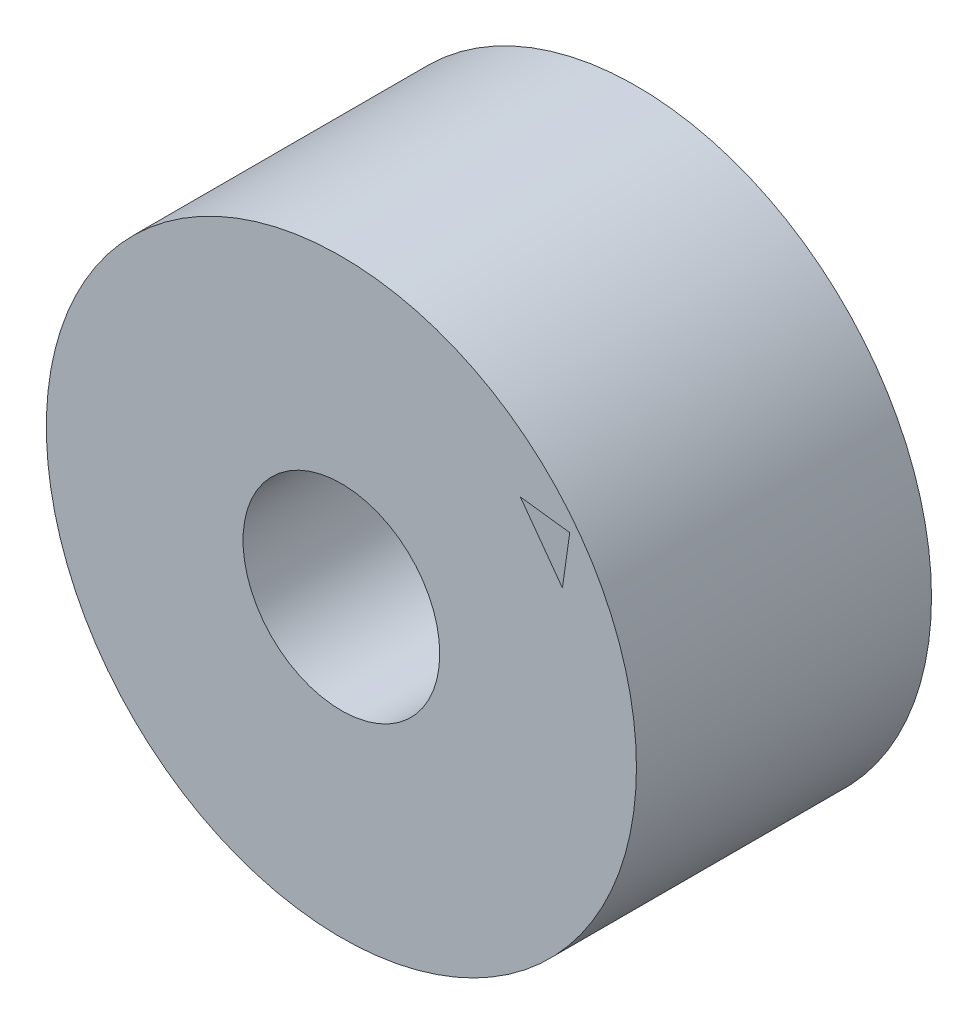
ISO-10303-21;
HEADER;
FILE_DESCRIPTION(('STEP AP214'),'2;1');
FILE_NAME('part.step','',(''),(''),'','','');
FILE_SCHEMA(('AUTOMOTIVE_DESIGN { 1 0 10303 214 1 1 1 1 }'));
ENDSEC;
DATA;
#1=APPLICATION_CONTEXT('core data for automotive mechanical design processes');
#2=APPLICATION_PROTOCOL_DEFINITION('international standard','automotive_design',2000,#1);
#3=PRODUCT_CONTEXT('',#1,'mechanical');
#4=PRODUCT('Part','Part','',(#3));
#5=PRODUCT_RELATED_PRODUCT_CATEGORY('part','',(#4));
#6=PRODUCT_DEFINITION_FORMATION('','',#4);
#7=PRODUCT_DEFINITION_CONTEXT('part definition',#1,'design');
#8=PRODUCT_DEFINITION('design','',#6,#7);
#9=PRODUCT_DEFINITION_SHAPE('','',#8);
#10=(LENGTH_UNIT() NAMED_UNIT(*) SI_UNIT(.MILLI.,.METRE.));
#11=(NAMED_UNIT(*) PLANE_ANGLE_UNIT() SI_UNIT($,.RADIAN.));
#12=(NAMED_UNIT(*) SI_UNIT($,.STERADIAN.) SOLID_ANGLE_UNIT());
#13=UNCERTAINTY_MEASURE_WITH_UNIT(LENGTH_MEASURE(1.E-05),#10,'distance_accuracy_value','');
#14=(GEOMETRIC_REPRESENTATION_CONTEXT(3) GLOBAL_UNCERTAINTY_ASSIGNED_CONTEXT((#13)) GLOBAL_UNIT_ASSIGNED_CONTEXT((#10,
#11,#12)) REPRESENTATION_CONTEXT('',''));
#15=CARTESIAN_POINT('',(0.,0.,0.));
#16=DIRECTION('',(0.,0.,1.));
#17=DIRECTION('',(1.,0.,0.));
#18=AXIS2_PLACEMENT_3D('',#15,#16,#17);
#19=CARTESIAN_POINT('',(0.,0.,15.));
#20=DIRECTION('',(0.,0.,-1.));
#21=DIRECTION('',(-1.,0.,0.));
#22=AXIS2_PLACEMENT_3D('',#19,#20,#21);
#23=CYLINDRICAL_SURFACE('',#22,5.);
#24=CARTESIAN_POINT('',(0.,0.,15.));
#25=DIRECTION('',(0.,0.,-1.));
#26=DIRECTION('',(1.,0.,0.));
#27=AXIS2_PLACEMENT_3D('',#24,#25,#26);
#28=CIRCLE('',#27,5.);
#29=CARTESIAN_POINT('',(4.99999999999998,0.,15.));
#30=VERTEX_POINT('',#29);
#31=EDGE_CURVE('E11',#30,#30,#28,.T.);
#32=ORIENTED_EDGE('',*,*,#31,.F.);
#33=EDGE_LOOP('',(#32));
#34=FACE_BOUND('',#33,.T.);
#35=CARTESIAN_POINT('',(0.,0.,0.));
#36=DIRECTION('',(0.,0.,-1.));
#37=DIRECTION('',(1.,0.,0.));
#38=AXIS2_PLACEMENT_3D('',#35,#36,#37);
#39=CIRCLE('',#38,5.);
#40=CARTESIAN_POINT('',(5.,0.,0.));
#41=VERTEX_POINT('',#40);
#42=EDGE_CURVE('E113',#41,#41,#39,.T.);
#43=ORIENTED_EDGE('',*,*,#42,.T.);
#44=EDGE_LOOP('',(#43));
#45=FACE_BOUND('',#44,.T.);
#46=ADVANCED_FACE('F46',(#34,#45),#23,.F.);
#47=CARTESIAN_POINT('',(0.,0.,15.));
#48=DIRECTION('',(0.,0.,-1.));
#49=DIRECTION('',(-1.,0.,0.));
#50=AXIS2_PLACEMENT_3D('',#47,#48,#49);
#51=CYLINDRICAL_SURFACE('',#50,15.);
#52=CARTESIAN_POINT('',(0.,0.,15.));
#53=DIRECTION('',(0.,0.,-1.));
#54=DIRECTION('',(1.,0.,0.));
#55=AXIS2_PLACEMENT_3D('',#52,#53,#54);
#56=CIRCLE('',#55,15.);
#57=CARTESIAN_POINT('',(15.,0.,15.));
#58=VERTEX_POINT('',#57);
#59=EDGE_CURVE('E55',#58,#58,#56,.T.);
#60=ORIENTED_EDGE('',*,*,#59,.T.);
#61=EDGE_LOOP('',(#60));
#62=FACE_BOUND('',#61,.T.);
#63=CARTESIAN_POINT('',(0.,0.,0.));
#64=DIRECTION('',(0.,0.,-1.));
#65=DIRECTION('',(1.,0.,0.));
#66=AXIS2_PLACEMENT_3D('',#63,#64,#65);
#67=CIRCLE('',#66,15.);
#68=CARTESIAN_POINT('',(15.,0.,0.));
#69=VERTEX_POINT('',#68);
#70=EDGE_CURVE('E107',#69,#69,#67,.T.);
#71=ORIENTED_EDGE('',*,*,#70,.F.);
#72=EDGE_LOOP('',(#71));
#73=FACE_BOUND('',#72,.T.);
#74=ADVANCED_FACE('F48',(#62,#73),#51,.T.);
#75=CARTESIAN_POINT('',(0.,0.,15.));
#76=DIRECTION('',(0.,0.,-1.));
#77=DIRECTION('',(-1.,0.,0.));
#78=AXIS2_PLACEMENT_3D('',#75,#76,#77);
#79=PLANE('',#78);
#80=DIRECTION('',(-0.588229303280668,0.808694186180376,0.));
#81=VECTOR('',#80,1.);
#82=CARTESIAN_POINT('',(11.2360220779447,6.02112797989,15.));
#83=LINE('',#82,#81);
#84=CARTESIAN_POINT('',(11.2360220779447,6.02112797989,15.));
#85=VERTEX_POINT('',#84);
#86=CARTESIAN_POINT('',(9.10026681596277,8.95735175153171,15.));
#87=VERTEX_POINT('',#86);
#88=EDGE_CURVE('E62',#85,#87,#83,.T.);
#89=ORIENTED_EDGE('',*,*,#88,.T.);
#90=DIRECTION('',(0.992258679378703,-0.12418821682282,0.));
#91=VECTOR('',#90,1.);
#92=CARTESIAN_POINT('',(9.10026681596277,8.95735175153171,15.));
#93=LINE('',#92,#91);
#94=CARTESIAN_POINT('',(11.610111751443,8.64322684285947,15.));
#95=VERTEX_POINT('',#94);
#96=EDGE_CURVE('E98',#87,#95,#93,.T.);
#97=ORIENTED_EDGE('',*,*,#96,.T.);
#98=DIRECTION('',(-0.141237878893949,-0.989975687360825,0.));
#99=VECTOR('',#98,1.);
#100=CARTESIAN_POINT('',(11.610111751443,8.64322684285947,15.));
#101=LINE('',#100,#99);
#102=EDGE_CURVE('E101',#95,#85,#101,.T.);
#103=ORIENTED_EDGE('',*,*,#102,.T.);
#104=EDGE_LOOP('',(#89,#97,#103));
#105=FACE_BOUND('',#104,.T.);
#106=ORIENTED_EDGE('',*,*,#31,.T.);
#107=EDGE_LOOP('',(#106));
#108=FACE_BOUND('',#107,.T.);
#109=ORIENTED_EDGE('',*,*,#59,.F.);
#110=EDGE_LOOP('',(#109));
#111=FACE_BOUND('',#110,.T.);
#112=ADVANCED_FACE('F121',(#105,#108,#111),#79,.F.);
#113=CARTESIAN_POINT('',(0.,0.,0.));
#114=DIRECTION('',(0.,0.,-1.));
#115=DIRECTION('',(-1.,0.,0.));
#116=AXIS2_PLACEMENT_3D('',#113,#114,#115);
#117=PLANE('',#116);
#118=DIRECTION('',(0.992258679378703,-0.12418821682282,0.));
#119=VECTOR('',#118,1.);
#120=CARTESIAN_POINT('',(9.10026681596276,8.95735175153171,0.));
#121=LINE('',#120,#119);
#122=CARTESIAN_POINT('',(9.10026681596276,8.95735175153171,0.));
#123=VERTEX_POINT('',#122);
#124=CARTESIAN_POINT('',(11.610111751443,8.64322684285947,0.));
#125=VERTEX_POINT('',#124);
#126=EDGE_CURVE('E70',#123,#125,#121,.T.);
#127=ORIENTED_EDGE('',*,*,#126,.F.);
#128=DIRECTION('',(-0.588229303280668,0.808694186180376,0.));
#129=VECTOR('',#128,1.);
#130=CARTESIAN_POINT('',(11.2360220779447,6.02112797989,0.));
#131=LINE('',#130,#129);
#132=CARTESIAN_POINT('',(11.2360220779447,6.02112797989,0.));
#133=VERTEX_POINT('',#132);
#134=EDGE_CURVE('E84',#133,#123,#131,.T.);
#135=ORIENTED_EDGE('',*,*,#134,.F.);
#136=DIRECTION('',(-0.141237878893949,-0.989975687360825,0.));
#137=VECTOR('',#136,1.);
#138=CARTESIAN_POINT('',(11.610111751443,8.64322684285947,0.));
#139=LINE('',#138,#137);
#140=EDGE_CURVE('E92',#125,#133,#139,.T.);
#141=ORIENTED_EDGE('',*,*,#140,.F.);
#142=EDGE_LOOP('',(#127,#135,#141));
#143=FACE_BOUND('',#142,.T.);
#144=ORIENTED_EDGE('',*,*,#42,.F.);
#145=EDGE_LOOP('',(#144));
#146=FACE_BOUND('',#145,.T.);
#147=ORIENTED_EDGE('',*,*,#70,.T.);
#148=EDGE_LOOP('',(#147));
#149=FACE_BOUND('',#148,.T.);
#150=ADVANCED_FACE('F96',(#143,#146,#149),#117,.T.);
#151=CARTESIAN_POINT('',(9.10026681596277,8.95735175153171,15.));
#152=DIRECTION('',(0.12418821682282,0.992258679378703,0.));
#153=DIRECTION('',(-0.992258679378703,0.12418821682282,0.));
#154=AXIS2_PLACEMENT_3D('',#151,#152,#153);
#155=PLANE('',#154);
#156=ORIENTED_EDGE('',*,*,#126,.T.);
#157=DIRECTION('',(0.,0.,-1.));
#158=VECTOR('',#157,1.);
#159=CARTESIAN_POINT('',(11.610111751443,8.64322684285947,15.));
#160=LINE('',#159,#158);
#161=EDGE_CURVE('E89',#95,#125,#160,.T.);
#162=ORIENTED_EDGE('',*,*,#161,.F.);
#163=ORIENTED_EDGE('',*,*,#96,.F.);
#164=DIRECTION('',(0.,0.,-1.));
#165=VECTOR('',#164,1.);
#166=CARTESIAN_POINT('',(9.10026681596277,8.95735175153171,15.));
#167=LINE('',#166,#165);
#168=EDGE_CURVE('E88',#87,#123,#167,.T.);
#169=ORIENTED_EDGE('',*,*,#168,.T.);
#170=EDGE_LOOP('',(#156,#162,#163,#169));
#171=FACE_BOUND('',#170,.T.);
#172=ADVANCED_FACE('F129',(#171),#155,.F.);
#173=CARTESIAN_POINT('',(11.2360220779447,6.02112797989,15.));
#174=DIRECTION('',(-0.808694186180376,-0.588229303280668,0.));
#175=DIRECTION('',(0.588229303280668,-0.808694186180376,0.));
#176=AXIS2_PLACEMENT_3D('',#173,#174,#175);
#177=PLANE('',#176);
#178=ORIENTED_EDGE('',*,*,#134,.T.);
#179=ORIENTED_EDGE('',*,*,#168,.F.);
#180=ORIENTED_EDGE('',*,*,#88,.F.);
#181=DIRECTION('',(0.,0.,-1.));
#182=VECTOR('',#181,1.);
#183=CARTESIAN_POINT('',(11.2360220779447,6.02112797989,15.));
#184=LINE('',#183,#182);
#185=EDGE_CURVE('E80',#85,#133,#184,.T.);
#186=ORIENTED_EDGE('',*,*,#185,.T.);
#187=EDGE_LOOP('',(#178,#179,#180,#186));
#188=FACE_BOUND('',#187,.T.);
#189=ADVANCED_FACE('F82',(#188),#177,.F.);
#190=CARTESIAN_POINT('',(11.610111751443,8.64322684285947,15.));
#191=DIRECTION('',(0.989975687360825,-0.141237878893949,0.));
#192=DIRECTION('',(0.141237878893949,0.989975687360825,0.));
#193=AXIS2_PLACEMENT_3D('',#190,#191,#192);
#194=PLANE('',#193);
#195=ORIENTED_EDGE('',*,*,#140,.T.);
#196=ORIENTED_EDGE('',*,*,#185,.F.);
#197=ORIENTED_EDGE('',*,*,#102,.F.);
#198=ORIENTED_EDGE('',*,*,#161,.T.);
#199=EDGE_LOOP('',(#195,#196,#197,#198));
#200=FACE_BOUND('',#199,.T.);
#201=ADVANCED_FACE('F93',(#200),#194,.F.);
#202=CLOSED_SHELL('',(#46,#74,#112,#150,#172,#189,#201));
#203=MANIFOLD_SOLID_BREP('B2',#202);
#204=ADVANCED_BREP_SHAPE_REPRESENTATION('',(#18,#203),#14);
#205=SHAPE_DEFINITION_REPRESENTATION(#9,#204);
ENDSEC;
END-ISO-10303-21;
